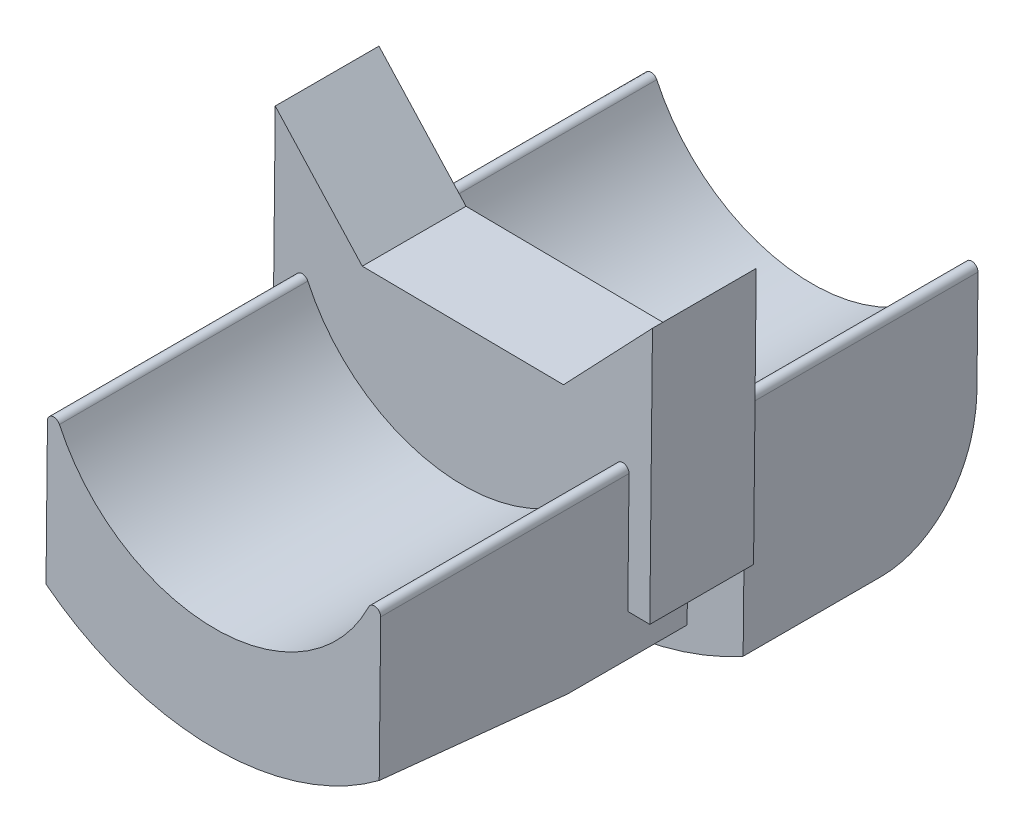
ISO-10303-21;
HEADER;
FILE_DESCRIPTION(('STEP AP214'),'2;1');
FILE_NAME('part.step','',(''),(''),'','','');
FILE_SCHEMA(('AUTOMOTIVE_DESIGN { 1 0 10303 214 1 1 1 1 }'));
ENDSEC;
DATA;
#1=APPLICATION_CONTEXT('core data for automotive mechanical design processes');
#2=APPLICATION_PROTOCOL_DEFINITION('international standard','automotive_design',2000,#1);
#3=PRODUCT_CONTEXT('',#1,'mechanical');
#4=PRODUCT('Part','Part','',(#3));
#5=PRODUCT_RELATED_PRODUCT_CATEGORY('part','',(#4));
#6=PRODUCT_DEFINITION_FORMATION('','',#4);
#7=PRODUCT_DEFINITION_CONTEXT('part definition',#1,'design');
#8=PRODUCT_DEFINITION('design','',#6,#7);
#9=PRODUCT_DEFINITION_SHAPE('','',#8);
#10=(LENGTH_UNIT() NAMED_UNIT(*) SI_UNIT(.MILLI.,.METRE.));
#11=(NAMED_UNIT(*) PLANE_ANGLE_UNIT() SI_UNIT($,.RADIAN.));
#12=(NAMED_UNIT(*) SI_UNIT($,.STERADIAN.) SOLID_ANGLE_UNIT());
#13=UNCERTAINTY_MEASURE_WITH_UNIT(LENGTH_MEASURE(1.E-05),#10,'distance_accuracy_value','');
#14=(GEOMETRIC_REPRESENTATION_CONTEXT(3) GLOBAL_UNCERTAINTY_ASSIGNED_CONTEXT((#13)) GLOBAL_UNIT_ASSIGNED_CONTEXT((#10,
#11,#12)) REPRESENTATION_CONTEXT('',''));
#15=CARTESIAN_POINT('',(0.,0.,0.));
#16=DIRECTION('',(0.,0.,1.));
#17=DIRECTION('',(1.,0.,0.));
#18=AXIS2_PLACEMENT_3D('',#15,#16,#17);
#19=CARTESIAN_POINT('',(-195.207995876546,26.3490502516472,-372.2));
#20=DIRECTION('',(0.,0.,1.));
#21=DIRECTION('',(0.,-1.,0.));
#22=AXIS2_PLACEMENT_3D('',#19,#20,#21);
#23=PLANE('',#22);
#24=CARTESIAN_POINT('',(-195.300000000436,26.3500000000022,-372.2));
#25=DIRECTION('',(0.,0.,-1.));
#26=DIRECTION('',(0.,1.,0.));
#27=AXIS2_PLACEMENT_3D('',#24,#25,#26);
#28=CIRCLE('',#27,9.25000000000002);
#29=CARTESIAN_POINT('',(-200.677971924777,18.8240503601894,-372.2));
#30=VERTEX_POINT('',#29);
#31=CARTESIAN_POINT('',(-190.078536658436,18.7146335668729,-372.2));
#32=VERTEX_POINT('',#31);
#33=EDGE_CURVE('E286',#30,#32,#28,.F.);
#34=ORIENTED_EDGE('',*,*,#33,.F.);
#35=DIRECTION('',(-0.0103223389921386,-0.999946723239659,0.));
#36=VECTOR('',#35,1.);
#37=CARTESIAN_POINT('',(-200.671584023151,19.4428598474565,-372.2));
#38=LINE('',#37,#36);
#39=CARTESIAN_POINT('',(-200.671584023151,19.4428598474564,-372.2));
#40=VERTEX_POINT('',#39);
#41=EDGE_CURVE('E304',#40,#30,#38,.T.);
#42=ORIENTED_EDGE('',*,*,#41,.F.);
#43=CARTESIAN_POINT('',(-195.300000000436,26.3500000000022,-372.2));
#44=DIRECTION('',(0.,0.,-1.));
#45=DIRECTION('',(0.,1.,0.));
#46=AXIS2_PLACEMENT_3D('',#43,#44,#45);
#47=CIRCLE('',#46,8.75000000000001);
#48=CARTESIAN_POINT('',(-190.072148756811,19.33344305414,-372.2));
#49=VERTEX_POINT('',#48);
#50=EDGE_CURVE('E145',#49,#40,#47,.T.);
#51=ORIENTED_EDGE('',*,*,#50,.F.);
#52=DIRECTION('',(0.0103223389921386,0.999946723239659,0.));
#53=VECTOR('',#52,1.);
#54=CARTESIAN_POINT('',(-190.078536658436,18.7146335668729,-372.2));
#55=LINE('',#54,#53);
#56=EDGE_CURVE('E262',#32,#49,#55,.T.);
#57=ORIENTED_EDGE('',*,*,#56,.F.);
#58=EDGE_LOOP('',(#34,#42,#51,#57));
#59=FACE_BOUND('',#58,.T.);
#60=ADVANCED_FACE('F17',(#59),#23,.F.);
#61=CARTESIAN_POINT('',(-195.300000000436,26.3500000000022,-362.4));
#62=DIRECTION('',(0.,0.,-1.));
#63=DIRECTION('',(0.,1.,0.));
#64=AXIS2_PLACEMENT_3D('',#61,#62,#63);
#65=CYLINDRICAL_SURFACE('',#64,5.45);
#66=CARTESIAN_POINT('',(-195.300000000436,26.3500000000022,-373.6));
#67=DIRECTION('',(0.,0.,-1.));
#68=DIRECTION('',(0.,1.,0.));
#69=AXIS2_PLACEMENT_3D('',#66,#67,#68);
#70=CIRCLE('',#69,5.45);
#71=CARTESIAN_POINT('',(-190.405004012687,23.9538542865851,-373.6));
#72=VERTEX_POINT('',#71);
#73=CARTESIAN_POINT('',(-200.24341787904,24.0554151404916,-373.6));
#74=VERTEX_POINT('',#73);
#75=EDGE_CURVE('E403',#72,#74,#70,.T.);
#76=ORIENTED_EDGE('',*,*,#75,.F.);
#77=DIRECTION('',(0.,0.,-1.));
#78=VECTOR('',#77,1.);
#79=CARTESIAN_POINT('',(-190.405004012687,23.9538542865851,-362.4));
#80=LINE('',#79,#78);
#81=CARTESIAN_POINT('',(-190.405004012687,23.9538542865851,-381.4));
#82=VERTEX_POINT('',#81);
#83=EDGE_CURVE('E244',#82,#72,#80,.F.);
#84=ORIENTED_EDGE('',*,*,#83,.F.);
#85=CARTESIAN_POINT('',(-195.300000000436,26.3500000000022,-381.4));
#86=DIRECTION('',(0.,0.,-1.));
#87=DIRECTION('',(0.,1.,0.));
#88=AXIS2_PLACEMENT_3D('',#85,#86,#87);
#89=CIRCLE('',#88,5.45);
#90=CARTESIAN_POINT('',(-200.24341787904,24.0554151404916,-381.4));
#91=VERTEX_POINT('',#90);
#92=EDGE_CURVE('E698',#91,#82,#89,.F.);
#93=ORIENTED_EDGE('',*,*,#92,.F.);
#94=DIRECTION('',(0.,0.,-1.));
#95=VECTOR('',#94,1.);
#96=CARTESIAN_POINT('',(-200.24341787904,24.0554151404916,-362.4));
#97=LINE('',#96,#95);
#98=EDGE_CURVE('E283',#74,#91,#97,.T.);
#99=ORIENTED_EDGE('',*,*,#98,.F.);
#100=EDGE_LOOP('',(#76,#84,#93,#99));
#101=FACE_BOUND('',#100,.T.);
#102=ADVANCED_FACE('F645',(#101),#65,.F.);
#103=CARTESIAN_POINT('',(-190.225371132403,23.8659223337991,-362.4));
#104=DIRECTION('',(0.,0.,-1.));
#105=DIRECTION('',(0.,1.,0.));
#106=AXIS2_PLACEMENT_3D('',#103,#104,#105);
#107=CYLINDRICAL_SURFACE('',#106,0.200000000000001);
#108=CARTESIAN_POINT('',(-190.225371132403,23.8659223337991,-381.4));
#109=DIRECTION('',(0.,0.,-1.));
#110=DIRECTION('',(0.,1.,0.));
#111=AXIS2_PLACEMENT_3D('',#108,#109,#110);
#112=CIRCLE('',#111,0.200000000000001);
#113=CARTESIAN_POINT('',(-190.025381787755,23.8638578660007,-381.4));
#114=VERTEX_POINT('',#113);
#115=EDGE_CURVE('E396',#82,#114,#112,.T.);
#116=ORIENTED_EDGE('',*,*,#115,.F.);
#117=ORIENTED_EDGE('',*,*,#83,.T.);
#118=CARTESIAN_POINT('',(-190.225371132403,23.8659223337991,-373.6));
#119=DIRECTION('',(0.,0.,-1.));
#120=DIRECTION('',(0.,1.,0.));
#121=AXIS2_PLACEMENT_3D('',#118,#119,#120);
#122=CIRCLE('',#121,0.200000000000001);
#123=CARTESIAN_POINT('',(-190.025381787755,23.8638578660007,-373.6));
#124=VERTEX_POINT('',#123);
#125=EDGE_CURVE('E256',#124,#72,#122,.F.);
#126=ORIENTED_EDGE('',*,*,#125,.F.);
#127=DIRECTION('',(0.,0.,1.));
#128=VECTOR('',#127,1.);
#129=CARTESIAN_POINT('',(-190.025381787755,23.8638578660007,-362.39));
#130=LINE('',#129,#128);
#131=EDGE_CURVE('E249',#114,#124,#130,.T.);
#132=ORIENTED_EDGE('',*,*,#131,.F.);
#133=EDGE_LOOP('',(#116,#117,#126,#132));
#134=FACE_BOUND('',#133,.T.);
#135=ADVANCED_FACE('F395',(#134),#107,.T.);
#136=CARTESIAN_POINT('',(-201.364194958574,20.1622670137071,-370.3));
#137=DIRECTION('',(-0.0103223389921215,-0.999946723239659,0.));
#138=DIRECTION('',(0.999946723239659,-0.0103223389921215,0.));
#139=AXIS2_PLACEMENT_3D('',#136,#137,#138);
#140=PLANE('',#139);
#141=DIRECTION('',(-0.999946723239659,0.0103223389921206,0.));
#142=VECTOR('',#141,1.);
#143=CARTESIAN_POINT('',(-189.364834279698,20.0383989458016,-373.6));
#144=LINE('',#143,#142);
#145=CARTESIAN_POINT('',(-189.364834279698,20.0383989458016,-373.6));
#146=VERTEX_POINT('',#145);
#147=CARTESIAN_POINT('',(-190.064796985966,20.0456245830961,-373.6));
#148=VERTEX_POINT('',#147);
#149=EDGE_CURVE('E253',#146,#148,#144,.T.);
#150=ORIENTED_EDGE('',*,*,#149,.F.);
#151=DIRECTION('',(0.,0.,1.));
#152=VECTOR('',#151,1.);
#153=CARTESIAN_POINT('',(-189.364834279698,20.0383989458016,-370.3));
#154=LINE('',#153,#152);
#155=CARTESIAN_POINT('',(-189.364834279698,20.0383989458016,-370.3));
#156=VERTEX_POINT('',#155);
#157=EDGE_CURVE('E178',#156,#146,#154,.F.);
#158=ORIENTED_EDGE('',*,*,#157,.F.);
#159=DIRECTION('',(0.999946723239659,-0.0103223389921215,0.));
#160=VECTOR('',#159,1.);
#161=CARTESIAN_POINT('',(-201.364194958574,20.1622670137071,-370.3));
#162=LINE('',#161,#160);
#163=CARTESIAN_POINT('',(-190.064796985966,20.0456245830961,-370.3));
#164=VERTEX_POINT('',#163);
#165=EDGE_CURVE('E241',#156,#164,#162,.F.);
#166=ORIENTED_EDGE('',*,*,#165,.T.);
#167=DIRECTION('',(0.,0.,1.));
#168=VECTOR('',#167,1.);
#169=CARTESIAN_POINT('',(-190.064796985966,20.0456245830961,-362.39));
#170=LINE('',#169,#168);
#171=EDGE_CURVE('E168',#148,#164,#170,.T.);
#172=ORIENTED_EDGE('',*,*,#171,.F.);
#173=EDGE_LOOP('',(#150,#158,#166,#172));
#174=FACE_BOUND('',#173,.T.);
#175=ADVANCED_FACE('F231',(#174),#140,.T.);
#176=CARTESIAN_POINT('',(-195.300000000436,26.3500000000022,-378.4));
#177=DIRECTION('',(0.,0.,-1.));
#178=DIRECTION('',(0.999946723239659,-0.0103223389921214,0.));
#179=AXIS2_PLACEMENT_3D('',#176,#177,#178);
#180=TOROIDAL_SURFACE('',#179,7.75000000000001,3.);
#181=CARTESIAN_POINT('',(-195.300000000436,26.3500000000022,-378.4));
#182=DIRECTION('',(0.,0.,-1.));
#183=DIRECTION('',(0.,1.,0.));
#184=AXIS2_PLACEMENT_3D('',#181,#182,#183);
#185=CIRCLE('',#184,10.75);
#186=CARTESIAN_POINT('',(-200.696259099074,17.0525332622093,-378.4));
#187=VERTEX_POINT('',#186);
#188=CARTESIAN_POINT('',(-190.096823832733,16.9431164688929,-378.4));
#189=VERTEX_POINT('',#188);
#190=EDGE_CURVE('E146',#187,#189,#185,.F.);
#191=ORIENTED_EDGE('',*,*,#190,.F.);
#192=CARTESIAN_POINT('',(-200.658084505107,20.7505865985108,-381.4));
#193=CARTESIAN_POINT('',(-200.659389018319,20.6242156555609,-381.400007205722));
#194=CARTESIAN_POINT('',(-200.66069416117,20.4977837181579,-381.395747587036));
#195=CARTESIAN_POINT('',(-200.663299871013,20.2453631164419,-381.377925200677));
#196=CARTESIAN_POINT('',(-200.664600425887,20.1193756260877,-381.364346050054));
#197=CARTESIAN_POINT('',(-200.667195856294,19.8679508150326,-381.326974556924));
#198=CARTESIAN_POINT('',(-200.668490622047,19.7425241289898,-381.30310878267));
#199=CARTESIAN_POINT('',(-200.671052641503,19.4943359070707,-381.244503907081));
#200=CARTESIAN_POINT('',(-200.67231991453,19.3715724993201,-381.209772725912));
#201=CARTESIAN_POINT('',(-200.67549016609,19.0644635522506,-381.106954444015));
#202=CARTESIAN_POINT('',(-200.677366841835,18.8826660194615,-381.030983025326));
#203=CARTESIAN_POINT('',(-200.680965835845,18.5340238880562,-380.850652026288));
#204=CARTESIAN_POINT('',(-200.682688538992,18.367142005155,-380.746366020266));
#205=CARTESIAN_POINT('',(-200.685114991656,18.1320864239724,-380.568439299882));
#206=CARTESIAN_POINT('',(-200.685901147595,18.0559298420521,-380.505168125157));
#207=CARTESIAN_POINT('',(-200.687408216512,17.9099369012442,-380.371731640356));
#208=CARTESIAN_POINT('',(-200.688129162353,17.8400973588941,-380.301569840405));
#209=CARTESIAN_POINT('',(-200.689496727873,17.7076184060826,-380.154675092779));
#210=CARTESIAN_POINT('',(-200.69014330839,17.6449827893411,-380.077938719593));
#211=CARTESIAN_POINT('',(-200.69135220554,17.5278743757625,-379.918473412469));
#212=CARTESIAN_POINT('',(-200.691914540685,17.4733997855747,-379.835745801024));
#213=CARTESIAN_POINT('',(-200.692875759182,17.3802845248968,-379.676650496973));
#214=CARTESIAN_POINT('',(-200.693286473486,17.3404977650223,-379.600951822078));
#215=CARTESIAN_POINT('',(-200.694033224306,17.2681584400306,-379.446178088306));
#216=CARTESIAN_POINT('',(-200.694369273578,17.2356046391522,-379.367103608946));
#217=CARTESIAN_POINT('',(-200.694961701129,17.1782149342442,-379.206365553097));
#218=CARTESIAN_POINT('',(-200.695218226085,17.1533648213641,-379.124707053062));
#219=CARTESIAN_POINT('',(-200.695648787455,17.1116554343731,-378.959412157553));
#220=CARTESIAN_POINT('',(-200.695822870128,17.0947916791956,-378.875776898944));
#221=CARTESIAN_POINT('',(-200.696055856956,17.0722217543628,-378.726714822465));
#222=CARTESIAN_POINT('',(-200.696132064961,17.0648393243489,-378.661537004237));
#223=CARTESIAN_POINT('',(-200.696233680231,17.0549956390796,-378.530908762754));
#224=CARTESIAN_POINT('',(-200.696259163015,17.0525270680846,-378.465458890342));
#225=CARTESIAN_POINT('',(-200.696259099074,17.0525332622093,-378.4));
#226=B_SPLINE_CURVE_WITH_KNOTS('',3,(#192,#193,#194,#195,#196,#197,#198,#199,#200,#201,#202,
#203,#204,#205,#206,#207,#208,#209,#210,#211,#212,#213,#214,#215,#216,#217,#218,#219,#220,#221,
#222,#223,#224,#225),.UNSPECIFIED.,.F.,.F.,(4,2,2,2,2,2,2,2,2,2,2,2,2,2,2,2,4),(0.,
0.379150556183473,0.75896933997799,1.14154559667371,1.52384362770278,2.11260707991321,
2.69985505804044,2.99652629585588,3.29304718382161,3.58972351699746,3.88633456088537,
4.14253608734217,4.39869380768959,4.65437621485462,4.90991499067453,5.10652091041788,
5.30283390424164),.UNSPECIFIED.);
#227=CARTESIAN_POINT('',(-200.658084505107,20.7505865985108,-381.4));
#228=VERTEX_POINT('',#227);
#229=EDGE_CURVE('E333',#228,#187,#226,.T.);
#230=ORIENTED_EDGE('',*,*,#229,.F.);
#231=CARTESIAN_POINT('',(-195.300000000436,26.3500000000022,-381.4));
#232=DIRECTION('',(0.,0.,1.));
#233=DIRECTION('',(-0.69136574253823,-0.722504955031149,0.));
#234=AXIS2_PLACEMENT_3D('',#231,#232,#233);
#235=CIRCLE('',#234,7.75000000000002);
#236=CARTESIAN_POINT('',(-190.058649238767,20.6411698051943,-381.4));
#237=VERTEX_POINT('',#236);
#238=EDGE_CURVE('E190',#237,#228,#235,.F.);
#239=ORIENTED_EDGE('',*,*,#238,.F.);
#240=CARTESIAN_POINT('',(-190.096823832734,16.9431164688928,-378.4));
#241=CARTESIAN_POINT('',(-190.096823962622,16.9431038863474,-378.475816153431));
#242=CARTESIAN_POINT('',(-190.096789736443,16.9464194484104,-378.55162620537));
#243=CARTESIAN_POINT('',(-190.096653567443,16.9596104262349,-378.702655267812));
#244=CARTESIAN_POINT('',(-190.096551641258,16.9694842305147,-378.777874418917));
#245=CARTESIAN_POINT('',(-190.096281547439,16.9956487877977,-378.926915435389));
#246=CARTESIAN_POINT('',(-190.09611361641,17.0119166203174,-379.000741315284));
#247=CARTESIAN_POINT('',(-190.095713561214,17.050670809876,-379.146722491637));
#248=CARTESIAN_POINT('',(-190.095481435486,17.0731573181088,-379.218877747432));
#249=CARTESIAN_POINT('',(-190.094692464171,17.1495866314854,-379.432013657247));
#250=CARTESIAN_POINT('',(-190.094042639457,17.2125365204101,-379.569873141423));
#251=CARTESIAN_POINT('',(-190.092521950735,17.359848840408,-379.833577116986));
#252=CARTESIAN_POINT('',(-190.091650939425,17.444225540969,-379.959413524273));
#253=CARTESIAN_POINT('',(-190.089682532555,17.6349092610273,-380.201187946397));
#254=CARTESIAN_POINT('',(-190.088577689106,17.74193777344,-380.316555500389));
#255=CARTESIAN_POINT('',(-190.086203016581,17.9719773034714,-380.529857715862));
#256=CARTESIAN_POINT('',(-190.084933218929,18.0949852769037,-380.627795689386));
#257=CARTESIAN_POINT('',(-190.082111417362,18.3683391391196,-380.815801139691));
#258=CARTESIAN_POINT('',(-190.080543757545,18.5202016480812,-380.903654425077));
#259=CARTESIAN_POINT('',(-190.077292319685,18.835175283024,-381.057030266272));
#260=CARTESIAN_POINT('',(-190.07560825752,18.998313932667,-381.122495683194));
#261=CARTESIAN_POINT('',(-190.072659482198,19.2839680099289,-381.216181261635));
#262=CARTESIAN_POINT('',(-190.071412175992,19.4047971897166,-381.249698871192));
#263=CARTESIAN_POINT('',(-190.06889153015,19.6489774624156,-381.30627568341));
#264=CARTESIAN_POINT('',(-190.067618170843,19.7723304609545,-381.329326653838));
#265=CARTESIAN_POINT('',(-190.065064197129,20.0197392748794,-381.365470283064));
#266=CARTESIAN_POINT('',(-190.063783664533,20.1437871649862,-381.378618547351));
#267=CARTESIAN_POINT('',(-190.061218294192,20.392299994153,-381.395878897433));
#268=CARTESIAN_POINT('',(-190.059933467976,20.5167638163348,-381.400006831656));
#269=CARTESIAN_POINT('',(-190.058649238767,20.6411698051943,-381.4));
#270=B_SPLINE_CURVE_WITH_KNOTS('',3,(#240,#241,#242,#243,#244,#245,#246,#247,#248,#249,#250,
#251,#252,#253,#254,#255,#256,#257,#258,#259,#260,#261,#262,#263,#264,#265,#266,#267,#268,#269),
.UNSPECIFIED.,.F.,.F.,(4,2,2,2,2,2,2,2,2,2,2,2,2,2,4),(0.,0.227365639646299,0.454675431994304,
0.681177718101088,0.907685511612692,1.36007322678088,1.81276300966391,2.28294719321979,
2.75304193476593,3.27741152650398,3.80310961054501,4.17885404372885,4.55489349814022,
4.92880534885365,5.30205971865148),.UNSPECIFIED.);
#271=EDGE_CURVE('E160',#189,#237,#270,.T.);
#272=ORIENTED_EDGE('',*,*,#271,.F.);
#273=EDGE_LOOP('',(#191,#230,#239,#272));
#274=FACE_BOUND('',#273,.T.);
#275=ADVANCED_FACE('F226',(#274),#180,.T.);
#276=CARTESIAN_POINT('',(-195.300000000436,26.3500000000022,-374.));
#277=DIRECTION('',(0.,0.,-1.));
#278=DIRECTION('',(0.,1.,0.));
#279=AXIS2_PLACEMENT_3D('',#276,#277,#278);
#280=CYLINDRICAL_SURFACE('',#279,10.75);
#281=CARTESIAN_POINT('',(-195.300000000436,26.3500000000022,-374.));
#282=DIRECTION('',(0.,0.,-1.));
#283=DIRECTION('',(0.,1.,0.));
#284=AXIS2_PLACEMENT_3D('',#281,#282,#283);
#285=CIRCLE('',#284,10.75);
#286=CARTESIAN_POINT('',(-190.096823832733,16.9431164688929,-374.));
#287=VERTEX_POINT('',#286);
#288=CARTESIAN_POINT('',(-200.696259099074,17.0525332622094,-374.));
#289=VERTEX_POINT('',#288);
#290=EDGE_CURVE('E20',#287,#289,#285,.T.);
#291=ORIENTED_EDGE('',*,*,#290,.T.);
#292=DIRECTION('',(0.,0.,1.));
#293=VECTOR('',#292,1.);
#294=CARTESIAN_POINT('',(-200.696259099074,17.0525332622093,-362.39));
#295=LINE('',#294,#293);
#296=EDGE_CURVE('E335',#187,#289,#295,.T.);
#297=ORIENTED_EDGE('',*,*,#296,.F.);
#298=ORIENTED_EDGE('',*,*,#190,.T.);
#299=DIRECTION('',(0.,0.,1.));
#300=VECTOR('',#299,1.);
#301=CARTESIAN_POINT('',(-190.096823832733,16.9431164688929,-362.39));
#302=LINE('',#301,#300);
#303=EDGE_CURVE('E153',#287,#189,#302,.F.);
#304=ORIENTED_EDGE('',*,*,#303,.F.);
#305=EDGE_LOOP('',(#291,#297,#298,#304));
#306=FACE_BOUND('',#305,.T.);
#307=ADVANCED_FACE('F158',(#306),#280,.T.);
#308=CARTESIAN_POINT('',(-195.300000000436,26.3500000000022,-374.));
#309=DIRECTION('',(0.,0.,-1.));
#310=DIRECTION('',(0.,1.,0.));
#311=AXIS2_PLACEMENT_3D('',#308,#309,#310);
#312=PLANE('',#311);
#313=CARTESIAN_POINT('',(-195.300000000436,26.3500000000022,-374.));
#314=DIRECTION('',(0.,0.,-1.));
#315=DIRECTION('',(0.,1.,0.));
#316=AXIS2_PLACEMENT_3D('',#313,#314,#315);
#317=CIRCLE('',#316,8.75000000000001);
#318=CARTESIAN_POINT('',(-200.671584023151,19.4428598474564,-374.));
#319=VERTEX_POINT('',#318);
#320=CARTESIAN_POINT('',(-190.072148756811,19.33344305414,-374.));
#321=VERTEX_POINT('',#320);
#322=EDGE_CURVE('E677',#319,#321,#317,.F.);
#323=ORIENTED_EDGE('',*,*,#322,.F.);
#324=DIRECTION('',(-0.0103223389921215,-0.999946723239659,0.));
#325=VECTOR('',#324,1.);
#326=CARTESIAN_POINT('',(-200.61282537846,25.1349335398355,-374.));
#327=LINE('',#326,#325);
#328=EDGE_CURVE('E141',#289,#319,#327,.F.);
#329=ORIENTED_EDGE('',*,*,#328,.F.);
#330=ORIENTED_EDGE('',*,*,#290,.F.);
#331=DIRECTION('',(0.0103223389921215,0.999946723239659,0.));
#332=VECTOR('',#331,1.);
#333=CARTESIAN_POINT('',(-190.013390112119,25.025516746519,-374.));
#334=LINE('',#333,#332);
#335=EDGE_CURVE('E140',#321,#287,#334,.F.);
#336=ORIENTED_EDGE('',*,*,#335,.F.);
#337=EDGE_LOOP('',(#323,#329,#330,#336));
#338=FACE_BOUND('',#337,.T.);
#339=ADVANCED_FACE('F139',(#338),#312,.F.);
#340=CARTESIAN_POINT('',(-195.300000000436,26.3500000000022,-372.2));
#341=DIRECTION('',(0.,0.,-1.));
#342=DIRECTION('',(0.,1.,0.));
#343=AXIS2_PLACEMENT_3D('',#340,#341,#342);
#344=CYLINDRICAL_SURFACE('',#343,8.75000000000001);
#345=DIRECTION('',(0.,0.,1.));
#346=VECTOR('',#345,1.);
#347=CARTESIAN_POINT('',(-200.671584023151,19.4428598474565,-362.39));
#348=LINE('',#347,#346);
#349=EDGE_CURVE('E371',#319,#40,#348,.T.);
#350=ORIENTED_EDGE('',*,*,#349,.F.);
#351=ORIENTED_EDGE('',*,*,#322,.T.);
#352=DIRECTION('',(0.,0.,1.));
#353=VECTOR('',#352,1.);
#354=CARTESIAN_POINT('',(-190.072148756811,19.33344305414,-362.39));
#355=LINE('',#354,#353);
#356=EDGE_CURVE('E156',#49,#321,#355,.F.);
#357=ORIENTED_EDGE('',*,*,#356,.F.);
#358=ORIENTED_EDGE('',*,*,#50,.T.);
#359=EDGE_LOOP('',(#350,#351,#357,#358));
#360=FACE_BOUND('',#359,.T.);
#361=ADVANCED_FACE('F217',(#360),#344,.T.);
#362=CARTESIAN_POINT('',(-195.300000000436,26.3500000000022,-318.610889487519));
#363=DIRECTION('',(0.,0.,-1.));
#364=DIRECTION('',(0.,1.,0.));
#365=AXIS2_PLACEMENT_3D('',#362,#363,#364);
#366=CYLINDRICAL_SURFACE('',#365,9.25000000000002);
#367=DIRECTION('',(0.,0.,1.));
#368=VECTOR('',#367,1.);
#369=CARTESIAN_POINT('',(-200.677971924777,18.8240503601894,-362.39));
#370=LINE('',#369,#368);
#371=CARTESIAN_POINT('',(-200.677971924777,18.8240503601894,-368.4));
#372=VERTEX_POINT('',#371);
#373=EDGE_CURVE('E360',#30,#372,#370,.T.);
#374=ORIENTED_EDGE('',*,*,#373,.F.);
#375=ORIENTED_EDGE('',*,*,#33,.T.);
#376=DIRECTION('',(0.,0.,1.));
#377=VECTOR('',#376,1.);
#378=CARTESIAN_POINT('',(-190.078536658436,18.7146335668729,-362.39));
#379=LINE('',#378,#377);
#380=CARTESIAN_POINT('',(-190.078536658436,18.7146335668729,-368.4));
#381=VERTEX_POINT('',#380);
#382=EDGE_CURVE('E336',#381,#32,#379,.F.);
#383=ORIENTED_EDGE('',*,*,#382,.F.);
#384=CARTESIAN_POINT('',(-195.300000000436,26.3500000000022,-368.4));
#385=DIRECTION('',(0.,0.,-1.));
#386=DIRECTION('',(0.999946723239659,-0.0103223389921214,0.));
#387=AXIS2_PLACEMENT_3D('',#384,#385,#386);
#388=CIRCLE('',#387,9.25000000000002);
#389=EDGE_CURVE('E183',#372,#381,#388,.F.);
#390=ORIENTED_EDGE('',*,*,#389,.F.);
#391=EDGE_LOOP('',(#374,#375,#383,#390));
#392=FACE_BOUND('',#391,.T.);
#393=ADVANCED_FACE('F213',(#392),#366,.T.);
#394=CARTESIAN_POINT('',(-200.424827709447,23.9712101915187,-362.4));
#395=DIRECTION('',(0.,0.,-1.));
#396=DIRECTION('',(0.,1.,0.));
#397=AXIS2_PLACEMENT_3D('',#394,#395,#396);
#398=CYLINDRICAL_SURFACE('',#397,0.200000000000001);
#399=CARTESIAN_POINT('',(-200.424827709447,23.9712101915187,-381.4));
#400=DIRECTION('',(0.,0.,-1.));
#401=DIRECTION('',(0.,1.,0.));
#402=AXIS2_PLACEMENT_3D('',#399,#400,#401);
#403=CIRCLE('',#402,0.200000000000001);
#404=CARTESIAN_POINT('',(-200.624817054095,23.9732746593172,-381.4));
#405=VERTEX_POINT('',#404);
#406=EDGE_CURVE('E285',#405,#91,#403,.T.);
#407=ORIENTED_EDGE('',*,*,#406,.F.);
#408=DIRECTION('',(0.,0.,1.));
#409=VECTOR('',#408,1.);
#410=CARTESIAN_POINT('',(-200.624817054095,23.9732746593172,-362.39));
#411=LINE('',#410,#409);
#412=CARTESIAN_POINT('',(-200.624817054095,23.9732746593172,-373.6));
#413=VERTEX_POINT('',#412);
#414=EDGE_CURVE('E196',#413,#405,#411,.F.);
#415=ORIENTED_EDGE('',*,*,#414,.F.);
#416=CARTESIAN_POINT('',(-200.424827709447,23.9712101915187,-373.6));
#417=DIRECTION('',(0.,0.,-1.));
#418=DIRECTION('',(0.,1.,0.));
#419=AXIS2_PLACEMENT_3D('',#416,#417,#418);
#420=CIRCLE('',#419,0.200000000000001);
#421=EDGE_CURVE('E453',#74,#413,#420,.F.);
#422=ORIENTED_EDGE('',*,*,#421,.F.);
#423=ORIENTED_EDGE('',*,*,#98,.T.);
#424=EDGE_LOOP('',(#407,#415,#422,#423));
#425=FACE_BOUND('',#424,.T.);
#426=ADVANCED_FACE('F209',(#425),#398,.T.);
#427=CARTESIAN_POINT('',(-195.300000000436,26.3500000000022,-381.4));
#428=DIRECTION('',(0.,0.,-1.));
#429=DIRECTION('',(0.,1.,0.));
#430=AXIS2_PLACEMENT_3D('',#427,#428,#429);
#431=PLANE('',#430);
#432=DIRECTION('',(0.0103223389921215,0.999946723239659,0.));
#433=VECTOR('',#432,1.);
#434=CARTESIAN_POINT('',(-190.013390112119,25.025516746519,-381.4));
#435=LINE('',#434,#433);
#436=EDGE_CURVE('E162',#237,#114,#435,.T.);
#437=ORIENTED_EDGE('',*,*,#436,.F.);
#438=ORIENTED_EDGE('',*,*,#238,.T.);
#439=DIRECTION('',(-0.0103223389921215,-0.999946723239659,0.));
#440=VECTOR('',#439,1.);
#441=CARTESIAN_POINT('',(-200.61282537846,25.1349335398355,-381.4));
#442=LINE('',#441,#440);
#443=EDGE_CURVE('E275',#405,#228,#442,.T.);
#444=ORIENTED_EDGE('',*,*,#443,.F.);
#445=ORIENTED_EDGE('',*,*,#406,.T.);
#446=ORIENTED_EDGE('',*,*,#92,.T.);
#447=ORIENTED_EDGE('',*,*,#115,.T.);
#448=EDGE_LOOP('',(#437,#438,#444,#445,#446,#447));
#449=FACE_BOUND('',#448,.T.);
#450=ADVANCED_FACE('F198',(#449),#431,.T.);
#451=CARTESIAN_POINT('',(-201.364194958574,20.1622670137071,-370.3));
#452=DIRECTION('',(-0.0103223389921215,-0.999946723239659,0.));
#453=DIRECTION('',(0.999946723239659,-0.0103223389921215,0.));
#454=AXIS2_PLACEMENT_3D('',#451,#452,#453);
#455=PLANE('',#454);
#456=DIRECTION('',(0.999946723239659,-0.0103223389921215,0.));
#457=VECTOR('',#456,1.);
#458=CARTESIAN_POINT('',(-201.364194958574,20.1622670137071,-370.3));
#459=LINE('',#458,#457);
#460=CARTESIAN_POINT('',(-200.664232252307,20.1550413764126,-370.3));
#461=VERTEX_POINT('',#460);
#462=CARTESIAN_POINT('',(-201.364194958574,20.1622670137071,-370.3));
#463=VERTEX_POINT('',#462);
#464=EDGE_CURVE('E448',#461,#463,#459,.F.);
#465=ORIENTED_EDGE('',*,*,#464,.T.);
#466=DIRECTION('',(0.,0.,1.));
#467=VECTOR('',#466,1.);
#468=CARTESIAN_POINT('',(-201.364194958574,20.1622670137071,-370.3));
#469=LINE('',#468,#467);
#470=CARTESIAN_POINT('',(-201.364194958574,20.1622670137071,-373.6));
#471=VERTEX_POINT('',#470);
#472=EDGE_CURVE('E274',#471,#463,#469,.T.);
#473=ORIENTED_EDGE('',*,*,#472,.F.);
#474=DIRECTION('',(-0.999946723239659,0.0103223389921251,0.));
#475=VECTOR('',#474,1.);
#476=CARTESIAN_POINT('',(-200.664232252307,20.1550413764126,-373.6));
#477=LINE('',#476,#475);
#478=CARTESIAN_POINT('',(-200.664232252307,20.1550413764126,-373.6));
#479=VERTEX_POINT('',#478);
#480=EDGE_CURVE('E257',#479,#471,#477,.T.);
#481=ORIENTED_EDGE('',*,*,#480,.F.);
#482=DIRECTION('',(0.,0.,1.));
#483=VECTOR('',#482,1.);
#484=CARTESIAN_POINT('',(-200.664232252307,20.1550413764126,-362.39));
#485=LINE('',#484,#483);
#486=EDGE_CURVE('E359',#461,#479,#485,.F.);
#487=ORIENTED_EDGE('',*,*,#486,.F.);
#488=EDGE_LOOP('',(#465,#473,#481,#487));
#489=FACE_BOUND('',#488,.T.);
#490=ADVANCED_FACE('F208',(#489),#455,.T.);
#491=CARTESIAN_POINT('',(-201.310518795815,25.3619899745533,-373.6));
#492=DIRECTION('',(0.,0.,-1.));
#493=DIRECTION('',(0.,1.,0.));
#494=AXIS2_PLACEMENT_3D('',#491,#492,#493);
#495=PLANE('',#494);
#496=ORIENTED_EDGE('',*,*,#125,.T.);
#497=ORIENTED_EDGE('',*,*,#75,.T.);
#498=ORIENTED_EDGE('',*,*,#421,.T.);
#499=DIRECTION('',(-0.0103223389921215,-0.999946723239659,0.));
#500=VECTOR('',#499,1.);
#501=CARTESIAN_POINT('',(-200.61282537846,25.1349335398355,-373.6));
#502=LINE('',#501,#500);
#503=EDGE_CURVE('E376',#479,#413,#502,.F.);
#504=ORIENTED_EDGE('',*,*,#503,.F.);
#505=ORIENTED_EDGE('',*,*,#480,.T.);
#506=DIRECTION('',(-0.0103223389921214,-0.999946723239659,0.));
#507=VECTOR('',#506,1.);
#508=CARTESIAN_POINT('',(-201.364194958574,20.1622670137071,-373.6));
#509=LINE('',#508,#507);
#510=CARTESIAN_POINT('',(-201.279551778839,28.3618301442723,-373.6));
#511=VERTEX_POINT('',#510);
#512=EDGE_CURVE('E271',#511,#471,#509,.T.);
#513=ORIENTED_EDGE('',*,*,#512,.F.);
#514=DIRECTION('',(-0.674735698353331,0.738059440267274,0.));
#515=VECTOR('',#514,1.);
#516=CARTESIAN_POINT('',(-198.510667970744,25.3330874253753,-373.6));
#517=LINE('',#516,#515);
#518=CARTESIAN_POINT('',(-198.510667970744,25.3330874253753,-373.6));
#519=VERTEX_POINT('',#518);
#520=EDGE_CURVE('E280',#519,#511,#517,.T.);
#521=ORIENTED_EDGE('',*,*,#520,.F.);
#522=DIRECTION('',(-0.999946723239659,0.0103223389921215,0.));
#523=VECTOR('',#522,1.);
#524=CARTESIAN_POINT('',(-198.510667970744,25.3330874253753,-373.6));
#525=LINE('',#524,#523);
#526=CARTESIAN_POINT('',(-192.11100894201,25.2670244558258,-373.6));
#527=VERTEX_POINT('',#526);
#528=EDGE_CURVE('E482',#527,#519,#525,.T.);
#529=ORIENTED_EDGE('',*,*,#528,.F.);
#530=DIRECTION('',(-0.68982809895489,-0.72397319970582,0.));
#531=VECTOR('',#530,1.);
#532=CARTESIAN_POINT('',(-192.11100894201,25.2670244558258,-373.6));
#533=LINE('',#532,#531);
#534=CARTESIAN_POINT('',(-189.280191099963,28.2379620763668,-373.6));
#535=VERTEX_POINT('',#534);
#536=EDGE_CURVE('E180',#535,#527,#533,.T.);
#537=ORIENTED_EDGE('',*,*,#536,.F.);
#538=DIRECTION('',(0.0103223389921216,0.999946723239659,0.));
#539=VECTOR('',#538,1.);
#540=CARTESIAN_POINT('',(-189.364834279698,20.0383989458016,-373.6));
#541=LINE('',#540,#539);
#542=EDGE_CURVE('E179',#146,#535,#541,.T.);
#543=ORIENTED_EDGE('',*,*,#542,.F.);
#544=ORIENTED_EDGE('',*,*,#149,.T.);
#545=DIRECTION('',(0.0103223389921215,0.999946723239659,0.));
#546=VECTOR('',#545,1.);
#547=CARTESIAN_POINT('',(-190.013390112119,25.025516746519,-373.6));
#548=LINE('',#547,#546);
#549=EDGE_CURVE('E172',#124,#148,#548,.F.);
#550=ORIENTED_EDGE('',*,*,#549,.F.);
#551=EDGE_LOOP('',(#496,#497,#498,#504,#505,#513,#521,#529,#537,#543,#544,#550));
#552=FACE_BOUND('',#551,.T.);
#553=ADVANCED_FACE('F405',(#552),#495,.T.);
#554=CARTESIAN_POINT('',(-195.300000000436,26.3500000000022,-368.4));
#555=DIRECTION('',(0.,0.,-1.));
#556=DIRECTION('',(-1.,0.,0.));
#557=AXIS2_PLACEMENT_3D('',#554,#555,#556);
#558=CONICAL_SURFACE('',#557,9.25000000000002,0.0831412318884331);
#559=CARTESIAN_POINT('',(-195.300000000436,26.3500000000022,-362.4));
#560=DIRECTION('',(0.,0.,-1.));
#561=DIRECTION('',(-1.,0.,0.));
#562=AXIS2_PLACEMENT_3D('',#559,#560,#561);
#563=CIRCLE('',#562,8.75000000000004);
#564=CARTESIAN_POINT('',(-190.072148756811,19.3334430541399,-362.4));
#565=VERTEX_POINT('',#564);
#566=CARTESIAN_POINT('',(-200.671584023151,19.4428598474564,-362.4));
#567=VERTEX_POINT('',#566);
#568=EDGE_CURVE('E324',#565,#567,#563,.T.);
#569=ORIENTED_EDGE('',*,*,#568,.T.);
#570=CARTESIAN_POINT('',(-200.677971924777,18.8240503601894,-368.4));
#571=CARTESIAN_POINT('',(-200.674689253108,19.142049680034,-365.27234467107));
#572=CARTESIAN_POINT('',(-200.671584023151,19.4428598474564,-362.4));
#573=B_SPLINE_CURVE_WITH_KNOTS('',2,(#570,#571,#572),.UNSPECIFIED.,.F.,.F.,(3,3),(0.,1.),.UNSPECIFIED.);
#574=EDGE_CURVE('E355',#372,#567,#573,.T.);
#575=ORIENTED_EDGE('',*,*,#574,.F.);
#576=ORIENTED_EDGE('',*,*,#389,.T.);
#577=CARTESIAN_POINT('',(-190.072148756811,19.33344305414,-362.4));
#578=CARTESIAN_POINT('',(-190.075253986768,19.0326328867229,-365.272344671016));
#579=CARTESIAN_POINT('',(-190.078536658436,18.7146335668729,-368.4));
#580=B_SPLINE_CURVE_WITH_KNOTS('',2,(#577,#578,#579),.UNSPECIFIED.,.F.,.F.,(3,3),(0.,1.),.UNSPECIFIED.);
#581=EDGE_CURVE('E171',#565,#381,#580,.T.);
#582=ORIENTED_EDGE('',*,*,#581,.F.);
#583=EDGE_LOOP('',(#569,#575,#576,#582));
#584=FACE_BOUND('',#583,.T.);
#585=ADVANCED_FACE('F510',(#584),#558,.T.);
#586=CARTESIAN_POINT('',(-192.11100894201,25.2670244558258,-370.3));
#587=DIRECTION('',(-0.72397319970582,0.68982809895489,0.));
#588=DIRECTION('',(-0.68982809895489,-0.72397319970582,0.));
#589=AXIS2_PLACEMENT_3D('',#586,#587,#588);
#590=PLANE('',#589);
#591=DIRECTION('',(0.689828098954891,0.723973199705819,0.));
#592=VECTOR('',#591,1.);
#593=CARTESIAN_POINT('',(-192.11100894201,25.2670244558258,-370.3));
#594=LINE('',#593,#592);
#595=CARTESIAN_POINT('',(-192.11100894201,25.2670244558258,-370.3));
#596=VERTEX_POINT('',#595);
#597=CARTESIAN_POINT('',(-189.280191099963,28.2379620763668,-370.3));
#598=VERTEX_POINT('',#597);
#599=EDGE_CURVE('E310',#596,#598,#594,.T.);
#600=ORIENTED_EDGE('',*,*,#599,.T.);
#601=DIRECTION('',(0.,0.,1.));
#602=VECTOR('',#601,1.);
#603=CARTESIAN_POINT('',(-189.280191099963,28.2379620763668,-370.3));
#604=LINE('',#603,#602);
#605=EDGE_CURVE('E175',#535,#598,#604,.T.);
#606=ORIENTED_EDGE('',*,*,#605,.F.);
#607=ORIENTED_EDGE('',*,*,#536,.T.);
#608=DIRECTION('',(0.,0.,1.));
#609=VECTOR('',#608,1.);
#610=CARTESIAN_POINT('',(-192.11100894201,25.2670244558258,-370.3));
#611=LINE('',#610,#609);
#612=EDGE_CURVE('E381',#596,#527,#611,.F.);
#613=ORIENTED_EDGE('',*,*,#612,.F.);
#614=EDGE_LOOP('',(#600,#606,#607,#613));
#615=FACE_BOUND('',#614,.T.);
#616=ADVANCED_FACE('F501',(#615),#590,.T.);
#617=CARTESIAN_POINT('',(-189.364834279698,20.0383989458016,-370.3));
#618=DIRECTION('',(0.999946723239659,-0.0103223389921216,0.));
#619=DIRECTION('',(0.0103223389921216,0.999946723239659,0.));
#620=AXIS2_PLACEMENT_3D('',#617,#618,#619);
#621=PLANE('',#620);
#622=DIRECTION('',(-0.0103223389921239,-0.999946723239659,0.));
#623=VECTOR('',#622,1.);
#624=CARTESIAN_POINT('',(-189.280191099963,28.2379620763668,-370.3));
#625=LINE('',#624,#623);
#626=EDGE_CURVE('E306',#598,#156,#625,.T.);
#627=ORIENTED_EDGE('',*,*,#626,.T.);
#628=ORIENTED_EDGE('',*,*,#157,.T.);
#629=ORIENTED_EDGE('',*,*,#542,.T.);
#630=ORIENTED_EDGE('',*,*,#605,.T.);
#631=EDGE_LOOP('',(#627,#628,#629,#630));
#632=FACE_BOUND('',#631,.T.);
#633=ADVANCED_FACE('F503',(#632),#621,.T.);
#634=CARTESIAN_POINT('',(-190.013390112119,25.025516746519,-362.39));
#635=DIRECTION('',(0.999946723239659,-0.0103223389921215,0.));
#636=DIRECTION('',(0.0103223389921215,0.999946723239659,0.));
#637=AXIS2_PLACEMENT_3D('',#634,#635,#636);
#638=PLANE('',#637);
#639=ORIENTED_EDGE('',*,*,#581,.T.);
#640=ORIENTED_EDGE('',*,*,#382,.T.);
#641=ORIENTED_EDGE('',*,*,#56,.T.);
#642=ORIENTED_EDGE('',*,*,#356,.T.);
#643=ORIENTED_EDGE('',*,*,#335,.T.);
#644=ORIENTED_EDGE('',*,*,#303,.T.);
#645=ORIENTED_EDGE('',*,*,#271,.T.);
#646=ORIENTED_EDGE('',*,*,#436,.T.);
#647=ORIENTED_EDGE('',*,*,#131,.T.);
#648=ORIENTED_EDGE('',*,*,#549,.T.);
#649=ORIENTED_EDGE('',*,*,#171,.T.);
#650=DIRECTION('',(0.0103223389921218,0.999946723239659,0.));
#651=VECTOR('',#650,1.);
#652=CARTESIAN_POINT('',(-190.064796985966,20.0456245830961,-370.3));
#653=LINE('',#652,#651);
#654=CARTESIAN_POINT('',(-190.025381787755,23.8638578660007,-370.3));
#655=VERTEX_POINT('',#654);
#656=EDGE_CURVE('E309',#164,#655,#653,.T.);
#657=ORIENTED_EDGE('',*,*,#656,.T.);
#658=DIRECTION('',(0.,0.,-1.));
#659=VECTOR('',#658,1.);
#660=CARTESIAN_POINT('',(-190.025381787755,23.8638578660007,-362.4));
#661=LINE('',#660,#659);
#662=CARTESIAN_POINT('',(-190.025381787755,23.8638578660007,-362.4));
#663=VERTEX_POINT('',#662);
#664=EDGE_CURVE('E332',#663,#655,#661,.T.);
#665=ORIENTED_EDGE('',*,*,#664,.F.);
#666=DIRECTION('',(-0.0103223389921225,-0.999946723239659,0.));
#667=VECTOR('',#666,1.);
#668=CARTESIAN_POINT('',(-190.025381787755,23.8638578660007,-362.4));
#669=LINE('',#668,#667);
#670=EDGE_CURVE('E328',#663,#565,#669,.T.);
#671=ORIENTED_EDGE('',*,*,#670,.T.);
#672=EDGE_LOOP('',(#639,#640,#641,#642,#643,#644,#645,#646,#647,#648,#649,#657,#665,#671));
#673=FACE_BOUND('',#672,.T.);
#674=ADVANCED_FACE('F151',(#673),#638,.T.);
#675=CARTESIAN_POINT('',(-200.61282537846,25.1349335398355,-362.39));
#676=DIRECTION('',(-0.999946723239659,0.0103223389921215,0.));
#677=DIRECTION('',(-0.0103223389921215,-0.999946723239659,0.));
#678=AXIS2_PLACEMENT_3D('',#675,#676,#677);
#679=PLANE('',#678);
#680=ORIENTED_EDGE('',*,*,#414,.T.);
#681=ORIENTED_EDGE('',*,*,#443,.T.);
#682=ORIENTED_EDGE('',*,*,#229,.T.);
#683=ORIENTED_EDGE('',*,*,#296,.T.);
#684=ORIENTED_EDGE('',*,*,#328,.T.);
#685=ORIENTED_EDGE('',*,*,#349,.T.);
#686=ORIENTED_EDGE('',*,*,#41,.T.);
#687=ORIENTED_EDGE('',*,*,#373,.T.);
#688=ORIENTED_EDGE('',*,*,#574,.T.);
#689=DIRECTION('',(0.0103223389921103,0.999946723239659,0.));
#690=VECTOR('',#689,1.);
#691=CARTESIAN_POINT('',(-200.671584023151,19.4428598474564,-362.4));
#692=LINE('',#691,#690);
#693=CARTESIAN_POINT('',(-200.624817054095,23.9732746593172,-362.4));
#694=VERTEX_POINT('',#693);
#695=EDGE_CURVE('E327',#567,#694,#692,.T.);
#696=ORIENTED_EDGE('',*,*,#695,.T.);
#697=DIRECTION('',(0.,0.,-1.));
#698=VECTOR('',#697,1.);
#699=CARTESIAN_POINT('',(-200.624817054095,23.9732746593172,-362.4));
#700=LINE('',#699,#698);
#701=CARTESIAN_POINT('',(-200.624817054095,23.9732746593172,-370.3));
#702=VERTEX_POINT('',#701);
#703=EDGE_CURVE('E323',#702,#694,#700,.F.);
#704=ORIENTED_EDGE('',*,*,#703,.F.);
#705=DIRECTION('',(-0.0103223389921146,-0.999946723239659,0.));
#706=VECTOR('',#705,1.);
#707=CARTESIAN_POINT('',(-200.624817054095,23.9732746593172,-370.3));
#708=LINE('',#707,#706);
#709=EDGE_CURVE('E291',#702,#461,#708,.T.);
#710=ORIENTED_EDGE('',*,*,#709,.T.);
#711=ORIENTED_EDGE('',*,*,#486,.T.);
#712=ORIENTED_EDGE('',*,*,#503,.T.);
#713=EDGE_LOOP('',(#680,#681,#682,#683,#684,#685,#686,#687,#688,#696,#704,#710,#711,#712));
#714=FACE_BOUND('',#713,.T.);
#715=ADVANCED_FACE('F343',(#714),#679,.T.);
#716=CARTESIAN_POINT('',(-201.364194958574,20.1622670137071,-370.3));
#717=DIRECTION('',(-0.999946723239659,0.0103223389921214,0.));
#718=DIRECTION('',(-0.0103223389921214,-0.999946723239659,0.));
#719=AXIS2_PLACEMENT_3D('',#716,#717,#718);
#720=PLANE('',#719);
#721=DIRECTION('',(0.0103223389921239,0.999946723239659,0.));
#722=VECTOR('',#721,1.);
#723=CARTESIAN_POINT('',(-201.364194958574,20.1622670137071,-370.3));
#724=LINE('',#723,#722);
#725=CARTESIAN_POINT('',(-201.279551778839,28.3618301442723,-370.3));
#726=VERTEX_POINT('',#725);
#727=EDGE_CURVE('E287',#463,#726,#724,.T.);
#728=ORIENTED_EDGE('',*,*,#727,.T.);
#729=DIRECTION('',(0.,0.,1.));
#730=VECTOR('',#729,1.);
#731=CARTESIAN_POINT('',(-201.279551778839,28.3618301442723,-370.3));
#732=LINE('',#731,#730);
#733=EDGE_CURVE('E483',#511,#726,#732,.T.);
#734=ORIENTED_EDGE('',*,*,#733,.F.);
#735=ORIENTED_EDGE('',*,*,#512,.T.);
#736=ORIENTED_EDGE('',*,*,#472,.T.);
#737=EDGE_LOOP('',(#728,#734,#735,#736));
#738=FACE_BOUND('',#737,.T.);
#739=ADVANCED_FACE('F348',(#738),#720,.T.);
#740=CARTESIAN_POINT('',(-198.510667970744,25.3330874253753,-370.3));
#741=DIRECTION('',(0.738059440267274,0.674735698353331,0.));
#742=DIRECTION('',(-0.674735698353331,0.738059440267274,0.));
#743=AXIS2_PLACEMENT_3D('',#740,#741,#742);
#744=PLANE('',#743);
#745=DIRECTION('',(0.67473569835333,-0.738059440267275,0.));
#746=VECTOR('',#745,1.);
#747=CARTESIAN_POINT('',(-201.279551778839,28.3618301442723,-370.3));
#748=LINE('',#747,#746);
#749=CARTESIAN_POINT('',(-198.510667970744,25.3330874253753,-370.3));
#750=VERTEX_POINT('',#749);
#751=EDGE_CURVE('E290',#726,#750,#748,.T.);
#752=ORIENTED_EDGE('',*,*,#751,.T.);
#753=DIRECTION('',(0.,0.,1.));
#754=VECTOR('',#753,1.);
#755=CARTESIAN_POINT('',(-198.510667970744,25.3330874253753,-370.3));
#756=LINE('',#755,#754);
#757=EDGE_CURVE('E479',#519,#750,#756,.T.);
#758=ORIENTED_EDGE('',*,*,#757,.F.);
#759=ORIENTED_EDGE('',*,*,#520,.T.);
#760=ORIENTED_EDGE('',*,*,#733,.T.);
#761=EDGE_LOOP('',(#752,#758,#759,#760));
#762=FACE_BOUND('',#761,.T.);
#763=ADVANCED_FACE('F491',(#762),#744,.T.);
#764=CARTESIAN_POINT('',(-198.510667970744,25.3330874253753,-370.3));
#765=DIRECTION('',(0.0103223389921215,0.999946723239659,0.));
#766=DIRECTION('',(-0.999946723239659,0.0103223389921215,0.));
#767=AXIS2_PLACEMENT_3D('',#764,#765,#766);
#768=PLANE('',#767);
#769=DIRECTION('',(0.999946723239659,-0.0103223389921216,0.));
#770=VECTOR('',#769,1.);
#771=CARTESIAN_POINT('',(-198.510667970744,25.3330874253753,-370.3));
#772=LINE('',#771,#770);
#773=EDGE_CURVE('E473',#750,#596,#772,.T.);
#774=ORIENTED_EDGE('',*,*,#773,.T.);
#775=ORIENTED_EDGE('',*,*,#612,.T.);
#776=ORIENTED_EDGE('',*,*,#528,.T.);
#777=ORIENTED_EDGE('',*,*,#757,.T.);
#778=EDGE_LOOP('',(#774,#775,#776,#777));
#779=FACE_BOUND('',#778,.T.);
#780=ADVANCED_FACE('F498',(#779),#768,.T.);
#781=CARTESIAN_POINT('',(-190.225371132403,23.8659223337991,-362.4));
#782=DIRECTION('',(0.,0.,-1.));
#783=DIRECTION('',(0.,1.,0.));
#784=AXIS2_PLACEMENT_3D('',#781,#782,#783);
#785=CYLINDRICAL_SURFACE('',#784,0.200000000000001);
#786=DIRECTION('',(0.,0.,-1.));
#787=VECTOR('',#786,1.);
#788=CARTESIAN_POINT('',(-190.405004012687,23.9538542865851,-362.4));
#789=LINE('',#788,#787);
#790=CARTESIAN_POINT('',(-190.405004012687,23.9538542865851,-370.3));
#791=VERTEX_POINT('',#790);
#792=CARTESIAN_POINT('',(-190.405004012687,23.9538542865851,-362.4));
#793=VERTEX_POINT('',#792);
#794=EDGE_CURVE('E316',#791,#793,#789,.F.);
#795=ORIENTED_EDGE('',*,*,#794,.T.);
#796=CARTESIAN_POINT('',(-190.225371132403,23.8659223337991,-362.4));
#797=DIRECTION('',(0.,0.,-1.));
#798=DIRECTION('',(0.,1.,0.));
#799=AXIS2_PLACEMENT_3D('',#796,#797,#798);
#800=CIRCLE('',#799,0.200000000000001);
#801=EDGE_CURVE('E329',#793,#663,#800,.T.);
#802=ORIENTED_EDGE('',*,*,#801,.T.);
#803=ORIENTED_EDGE('',*,*,#664,.T.);
#804=CARTESIAN_POINT('',(-190.225371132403,23.8659223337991,-370.3));
#805=DIRECTION('',(0.,0.,-1.));
#806=DIRECTION('',(0.,1.,0.));
#807=AXIS2_PLACEMENT_3D('',#804,#805,#806);
#808=CIRCLE('',#807,0.200000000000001);
#809=EDGE_CURVE('E318',#655,#791,#808,.F.);
#810=ORIENTED_EDGE('',*,*,#809,.T.);
#811=EDGE_LOOP('',(#795,#802,#803,#810));
#812=FACE_BOUND('',#811,.T.);
#813=ADVANCED_FACE('F529',(#812),#785,.T.);
#814=CARTESIAN_POINT('',(-195.300000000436,26.3500000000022,-362.4));
#815=DIRECTION('',(0.,0.,-1.));
#816=DIRECTION('',(0.,1.,0.));
#817=AXIS2_PLACEMENT_3D('',#814,#815,#816);
#818=PLANE('',#817);
#819=ORIENTED_EDGE('',*,*,#568,.F.);
#820=ORIENTED_EDGE('',*,*,#670,.F.);
#821=ORIENTED_EDGE('',*,*,#801,.F.);
#822=CARTESIAN_POINT('',(-195.300000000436,26.3500000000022,-362.4));
#823=DIRECTION('',(0.,0.,-1.));
#824=DIRECTION('',(0.,1.,0.));
#825=AXIS2_PLACEMENT_3D('',#822,#823,#824);
#826=CIRCLE('',#825,5.45);
#827=CARTESIAN_POINT('',(-200.24341787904,24.0554151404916,-362.4));
#828=VERTEX_POINT('',#827);
#829=EDGE_CURVE('E313',#793,#828,#826,.T.);
#830=ORIENTED_EDGE('',*,*,#829,.T.);
#831=CARTESIAN_POINT('',(-200.424827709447,23.9712101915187,-362.4));
#832=DIRECTION('',(0.,0.,-1.));
#833=DIRECTION('',(0.,1.,0.));
#834=AXIS2_PLACEMENT_3D('',#831,#832,#833);
#835=CIRCLE('',#834,0.200000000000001);
#836=EDGE_CURVE('E321',#694,#828,#835,.T.);
#837=ORIENTED_EDGE('',*,*,#836,.F.);
#838=ORIENTED_EDGE('',*,*,#695,.F.);
#839=EDGE_LOOP('',(#819,#820,#821,#830,#837,#838));
#840=FACE_BOUND('',#839,.T.);
#841=ADVANCED_FACE('F525',(#840),#818,.F.);
#842=CARTESIAN_POINT('',(-200.424827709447,23.9712101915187,-362.4));
#843=DIRECTION('',(0.,0.,-1.));
#844=DIRECTION('',(0.,1.,0.));
#845=AXIS2_PLACEMENT_3D('',#842,#843,#844);
#846=CYLINDRICAL_SURFACE('',#845,0.200000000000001);
#847=ORIENTED_EDGE('',*,*,#703,.T.);
#848=ORIENTED_EDGE('',*,*,#836,.T.);
#849=DIRECTION('',(0.,0.,-1.));
#850=VECTOR('',#849,1.);
#851=CARTESIAN_POINT('',(-200.24341787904,24.0554151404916,-362.4));
#852=LINE('',#851,#850);
#853=CARTESIAN_POINT('',(-200.24341787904,24.0554151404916,-370.3));
#854=VERTEX_POINT('',#853);
#855=EDGE_CURVE('E26',#828,#854,#852,.T.);
#856=ORIENTED_EDGE('',*,*,#855,.T.);
#857=CARTESIAN_POINT('',(-200.424827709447,23.9712101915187,-370.3));
#858=DIRECTION('',(0.,0.,-1.));
#859=DIRECTION('',(0.,1.,0.));
#860=AXIS2_PLACEMENT_3D('',#857,#858,#859);
#861=CIRCLE('',#860,0.200000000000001);
#862=EDGE_CURVE('E34',#854,#702,#861,.F.);
#863=ORIENTED_EDGE('',*,*,#862,.T.);
#864=EDGE_LOOP('',(#847,#848,#856,#863));
#865=FACE_BOUND('',#864,.T.);
#866=ADVANCED_FACE('F519',(#865),#846,.T.);
#867=CARTESIAN_POINT('',(-201.310518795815,25.3619899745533,-370.3));
#868=DIRECTION('',(0.,0.,-1.));
#869=DIRECTION('',(0.,1.,0.));
#870=AXIS2_PLACEMENT_3D('',#867,#868,#869);
#871=PLANE('',#870);
#872=ORIENTED_EDGE('',*,*,#751,.F.);
#873=ORIENTED_EDGE('',*,*,#727,.F.);
#874=ORIENTED_EDGE('',*,*,#464,.F.);
#875=ORIENTED_EDGE('',*,*,#709,.F.);
#876=ORIENTED_EDGE('',*,*,#862,.F.);
#877=CARTESIAN_POINT('',(-195.300000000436,26.3500000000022,-370.3));
#878=DIRECTION('',(0.,0.,-1.));
#879=DIRECTION('',(0.,1.,0.));
#880=AXIS2_PLACEMENT_3D('',#877,#878,#879);
#881=CIRCLE('',#880,5.45);
#882=EDGE_CURVE('E11',#854,#791,#881,.F.);
#883=ORIENTED_EDGE('',*,*,#882,.T.);
#884=ORIENTED_EDGE('',*,*,#809,.F.);
#885=ORIENTED_EDGE('',*,*,#656,.F.);
#886=ORIENTED_EDGE('',*,*,#165,.F.);
#887=ORIENTED_EDGE('',*,*,#626,.F.);
#888=ORIENTED_EDGE('',*,*,#599,.F.);
#889=ORIENTED_EDGE('',*,*,#773,.F.);
#890=EDGE_LOOP('',(#872,#873,#874,#875,#876,#883,#884,#885,#886,#887,#888,#889));
#891=FACE_BOUND('',#890,.T.);
#892=ADVANCED_FACE('F417',(#891),#871,.F.);
#893=CARTESIAN_POINT('',(-195.300000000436,26.3500000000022,-362.4));
#894=DIRECTION('',(0.,0.,-1.));
#895=DIRECTION('',(0.,1.,0.));
#896=AXIS2_PLACEMENT_3D('',#893,#894,#895);
#897=CYLINDRICAL_SURFACE('',#896,5.45);
#898=ORIENTED_EDGE('',*,*,#855,.F.);
#899=ORIENTED_EDGE('',*,*,#829,.F.);
#900=ORIENTED_EDGE('',*,*,#794,.F.);
#901=ORIENTED_EDGE('',*,*,#882,.F.);
#902=EDGE_LOOP('',(#898,#899,#900,#901));
#903=FACE_BOUND('',#902,.T.);
#904=ADVANCED_FACE('F512',(#903),#897,.F.);
#905=CLOSED_SHELL('',(#60,#102,#135,#175,#275,#307,#339,#361,#393,#426,#450,#490,#553,#585,#616,
#633,#674,#715,#739,#763,#780,#813,#841,#866,#892,#904));
#906=MANIFOLD_SOLID_BREP('B1',#905);
#907=ADVANCED_BREP_SHAPE_REPRESENTATION('',(#18,#906),#14);
#908=SHAPE_DEFINITION_REPRESENTATION(#9,#907);
ENDSEC;
END-ISO-10303-21;
